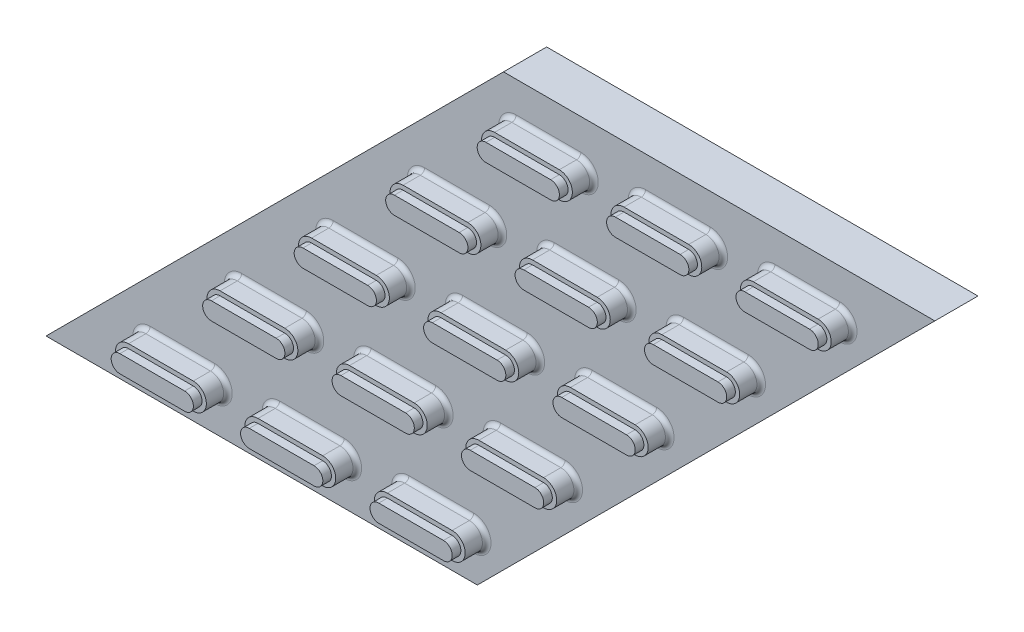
from build123d import *

# Parameters (mm, degrees)
EXTRUDE1_DEPTH         = 5
EXTRUDE2_DEPTH         = 5
FILLET1_R              = 1
EXTRUDE3_DEPTH         = 2
LPATTERN1_COUNT        = 3
LPATTERN1_PITCH        = 30
LPATTERN1_COUNT_DIR2   = 5
LPATTERN1_PITCH_DIR2   = 30
FILLET1_OF_LPATTERN1_R = 1


with BuildPart() as part:
    # Sketch1 → Extrude1 (new, symmetric)
    with BuildSketch(Plane.XY):
        Polygon((0, 0), (100, 0), (206.066017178, 106.066017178), (106.066017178, 106.066017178), align=None)
    extrude(amount=EXTRUDE1_DEPTH, both=True)

    # Sketch2 → Extrude2 (add)
    with BuildSketch(Plane.XY.offset(5)):
        with BuildLine():
            Line((24.142135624, 13.03143154), (39.142135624, 13.03143154))
            ThreePointArc((39.142135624, 13.03143154), (42.173567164, 10), (39.142135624, 6.96856846))
            Line((39.142135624, 6.96856846), (24.142135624, 6.96856846))
            ThreePointArc((24.142135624, 6.96856846), (21.110704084, 10), (24.142135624, 13.03143154))
        make_face()
    extrude2 = extrude(amount=EXTRUDE2_DEPTH)

    # Fillet1
    fillet1_edges = [part.edges().sort_by_distance(p)[0] for p in [
        (21.110704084, 10, 5),
        (31.642135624, 6.96856846, 5),
        (42.173567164, 10, 5),
        (31.642135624, 13.03143154, 5),
    ]]
    fillet(fillet1_edges, radius=FILLET1_R)

    # Sketch3 → Extrude3 (add)
    with BuildSketch(Plane.XY.offset(10)):
        with BuildLine():
            Line((24.142135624, 7.96856846), (39.142135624, 7.96856846))
            ThreePointArc((39.142135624, 7.96856846), (41.173567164, 10), (39.142135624, 12.03143154))
            Line((39.142135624, 12.03143154), (24.142135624, 12.03143154))
            ThreePointArc((24.142135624, 12.03143154), (22.110704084, 10), (24.142135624, 7.96856846))
        make_face()
    extrude3 = extrude(amount=EXTRUDE3_DEPTH)

    # LPattern1: Extrude2, Extrude3 3 × 5
    with Locations(*[Vector(1, 0, 0) * (i * LPATTERN1_PITCH) + Vector(0.7071067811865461, 0.707106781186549, 0) * (j * LPATTERN1_PITCH_DIR2) for i in range(LPATTERN1_COUNT) for j in range(LPATTERN1_COUNT_DIR2) if (i, j) != (0, 0)]):
        add(extrude2)
        add(extrude3)

    # Fillet1 of LPattern1
    fillet1_of_lpattern1_edges = [part.edges().sort_by_distance(p)[0] for p in [
        (42.323907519, 31.213203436, 5),
        (52.855339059, 28.181771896, 5),
        (63.386770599, 31.213203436, 5),
        (52.855339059, 34.244634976, 5),
        (63.537110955, 52.426406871, 5),
        (74.068542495, 49.394975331, 5),
        (84.599974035, 52.426406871, 5),
        (74.068542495, 55.457838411, 5),
        (84.750314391, 73.639610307, 5),
        (95.281745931, 70.608178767, 5),
        (105.813177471, 73.639610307, 5),
        (95.281745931, 76.671041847, 5),
        (105.963517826, 94.852813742, 5),
        (116.494949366, 91.821382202, 5),
        (127.026380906, 94.852813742, 5),
        (116.494949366, 97.884245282, 5),
        (51.110704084, 10, 5),
        (61.642135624, 6.96856846, 5),
        (72.173567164, 10, 5),
        (61.642135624, 13.03143154, 5),
        (72.323907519, 31.213203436, 5),
        (82.855339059, 28.181771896, 5),
        (93.386770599, 31.213203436, 5),
        (82.855339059, 34.244634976, 5),
        (93.537110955, 52.426406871, 5),
        (104.068542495, 49.394975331, 5),
        (114.599974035, 52.426406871, 5),
        (104.068542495, 55.457838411, 5),
        (114.750314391, 73.639610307, 5),
        (125.281745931, 70.608178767, 5),
        (135.813177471, 73.639610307, 5),
        (125.281745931, 76.671041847, 5),
        (135.963517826, 94.852813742, 5),
        (146.494949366, 91.821382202, 5),
        (157.026380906, 94.852813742, 5),
        (146.494949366, 97.884245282, 5),
        (81.110704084, 10, 5),
        (91.642135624, 6.96856846, 5),
        (102.173567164, 10, 5),
        (91.642135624, 13.03143154, 5),
        (102.323907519, 31.213203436, 5),
        (112.855339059, 28.181771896, 5),
        (123.386770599, 31.213203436, 5),
        (112.855339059, 34.244634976, 5),
        (123.537110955, 52.426406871, 5),
        (134.068542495, 49.394975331, 5),
        (144.599974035, 52.426406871, 5),
        (134.068542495, 55.457838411, 5),
        (144.750314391, 73.639610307, 5),
        (155.281745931, 70.608178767, 5),
        (165.813177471, 73.639610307, 5),
        (155.281745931, 76.671041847, 5),
        (165.963517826, 94.852813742, 5),
        (176.494949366, 91.821382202, 5),
        (187.026380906, 94.852813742, 5),
        (176.494949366, 97.884245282, 5),
    ]]
    fillet(fillet1_of_lpattern1_edges, radius=FILLET1_OF_LPATTERN1_R)


solid = part.part
